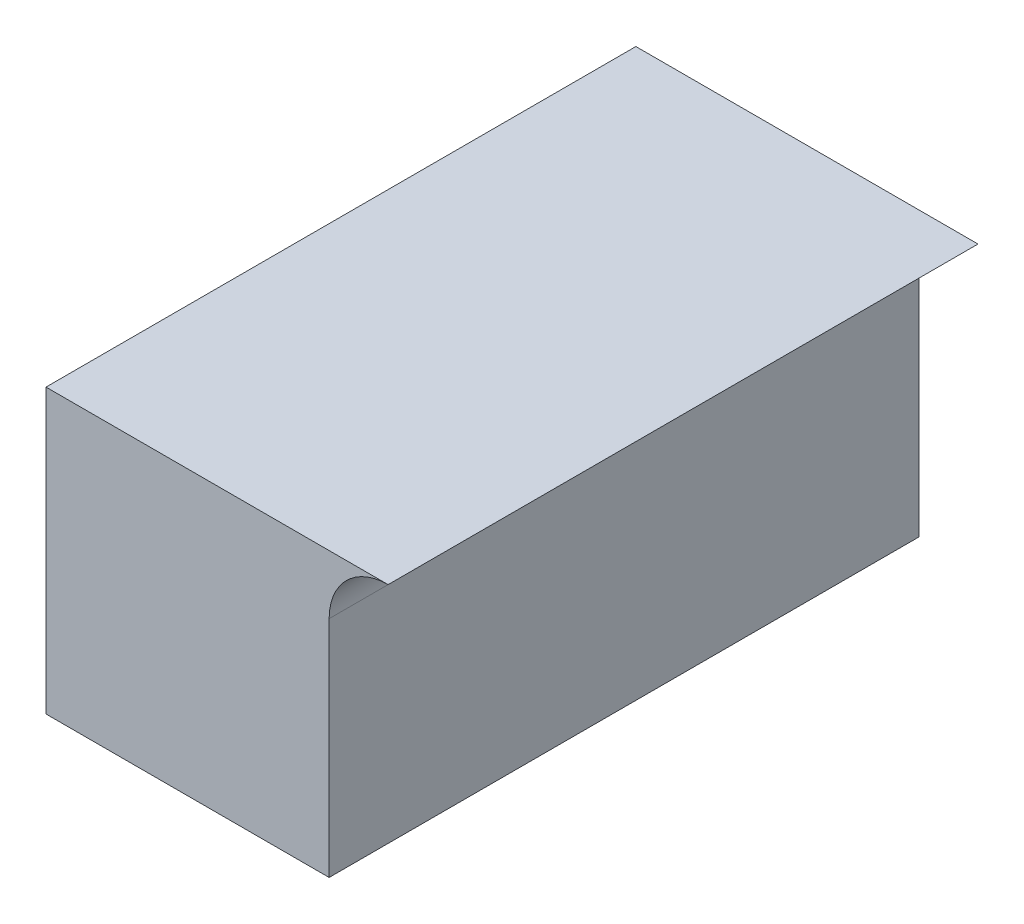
from build123d import *

# Parameters (mm, degrees)
SKETCH1_W           = 50
SKETCH1_H           = 5
BASE_EXTRUDE_DEPTH  = 25
LANCE_TOOL_SKETCH_W = 12
LANCE_TOOL_SKETCH_H = 12
LANCE_TOOL_DEPTH    = 12.5
FILLET_2_R          = 2.5
SKETCH3_W           = 50
SKETCH3_H           = 5
CUT_EXTRUDE1_DEPTH  = 58.175169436


with BuildPart() as part:
    # Sketch1 → Base-Extrude (new, symmetric)
    with BuildSketch(Plane.XY):
        with Locations((0, 2.5)):
            Rectangle(SKETCH1_W, SKETCH1_H)
    extrude(amount=BASE_EXTRUDE_DEPTH, both=True)

    # Lance Tool sketch → Lance Tool (add, symmetric)
    with BuildSketch(Plane.XY):
        with Locations((0, -6)):
            Rectangle(LANCE_TOOL_SKETCH_W, LANCE_TOOL_SKETCH_H)
    extrude(amount=LANCE_TOOL_DEPTH, both=True)

    # Fillet 2
    fillet_2_edges = [part.edges().sort_by_distance(p)[0] for p in [
        (6, 0, 0),
    ]]
    fillet(fillet_2_edges, radius=FILLET_2_R)

    # Sketch3 → Cut-Extrude1 (cut, through all)
    with BuildSketch(Plane(origin=(25, 0, 0), x_dir=(0, 0, -1), z_dir=(1, 0, 0))):
        with Locations((0, 2.5)):
            Rectangle(SKETCH3_W, SKETCH3_H)
    extrude(amount=-CUT_EXTRUDE1_DEPTH, mode=Mode.SUBTRACT)


solid = part.part
